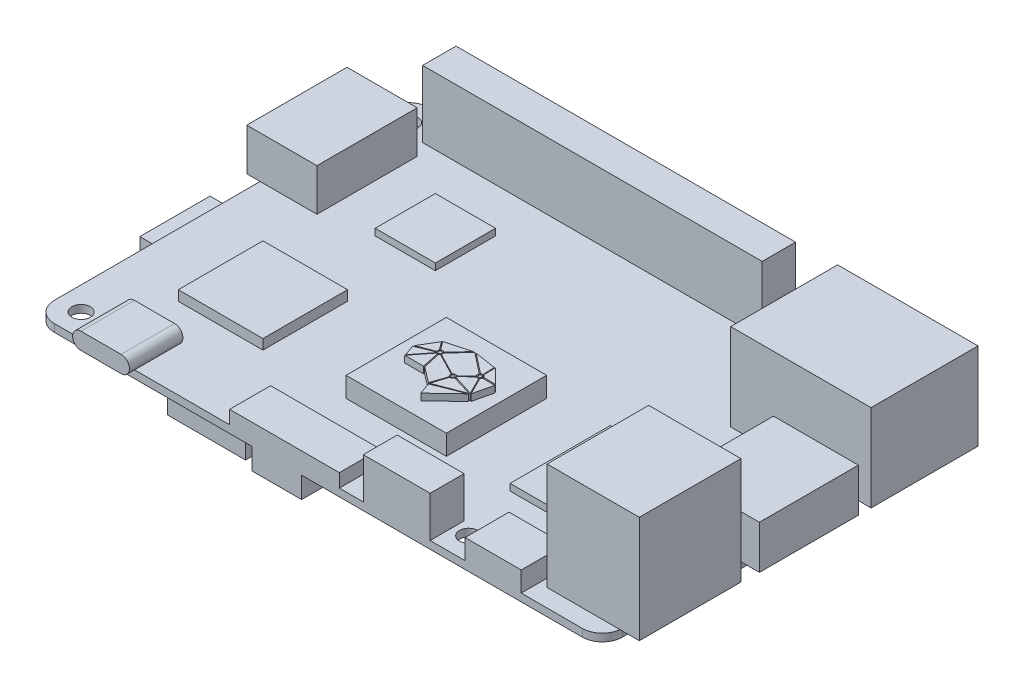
from build123d import *

# Parameters (mm, degrees)
SKETCH_1_W          = 85
SKETCH_1_H          = 56
EXTRUDE_1_DEPTH     = 1.14
FILLET_1_R          = 3
SKETCH_2_W          = 13.8
SKETCH_2_H          = 15.2
EXTRUDE_2_DEPTH     = 16
SKETCH_3_W          = 12.695877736
SKETCH_3_H          = 14.8
EXTRUDE_3_DEPTH     = 6.5
SKETCH_5_W          = 21
SKETCH_5_H          = 16
EXTRUDE_4_DEPTH     = 13
SKETCH_6_R          = 1.38
CUT_EXTRUDE_1_DEPTH = 56.769615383
SKETCH_7_W          = 50.8
SKETCH_7_H          = 5
EXTRUDE_5_DEPTH     = 10
SKETCH_8_W          = 10.5
SKETCH_8_H          = 15
EXTRUDE_6_DEPTH     = 6.3
SKETCH_9_W          = 14.5
SKETCH_9_H          = 14.5
EXTRUDE_7_DEPTH     = 2
SKETCH_10_W         = 8.805174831
SKETCH_10_H         = 10.5
EXTRUDE_8_DEPTH     = 2
EXTRUDE_9_DEPTH     = 8
SKETCH_13_W         = 16.41
SKETCH_13_H         = 6.12
EXTRUDE_10_DEPTH    = 2
SKETCH_14_W         = 10
SKETCH_14_H         = 5.08
EXTRUDE_11_DEPTH    = 6.12
SKETCH_15_W         = 11.7
SKETCH_15_H         = 5
EXTRUDE_12_DEPTH    = 2.81
SKETCH_16_W         = 7.42
SKETCH_16_H         = 5.15
EXTRUDE_13_DEPTH    = 3.18
SKETCH_17_W         = 8.4
SKETCH_17_H         = 6.58
EXTRUDE_14_DEPTH    = 3
SKETCH_19_W         = 12.66
SKETCH_19_H         = 12.66
EXTRUDE_15_DEPTH    = 1.5
SKETCH_20_W         = 15
SKETCH_20_H         = 15
EXTRUDE_16_DEPTH    = 3
SKETCH_22_W         = 10
SKETCH_22_H         = 15
EXTRUDE_17_DEPTH    = 1
SKETCH_23_W         = 9
SKETCH_23_H         = 9
EXTRUDE_18_DEPTH    = 1
SKETCH_27_R         = 0.223898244
SKETCH_27_R_2       = 0.241378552
EXTRUDE_19_DEPTH    = 1


with BuildPart() as part:
    # Sketch 1 → Extrude 1 (new body)
    with BuildSketch(Plane(origin=(0, 0, 0), x_dir=(1, 0, 0), z_dir=(0, 1, 0))):
        Rectangle(SKETCH_1_W, SKETCH_1_H)
    extrude(amount=EXTRUDE_1_DEPTH)

    # Fillet 1
    fillet_1_edges = [part.edges().sort_by_distance(p)[0] for p in [
        (42.5, 0.57, 28),
        (-42.5, 0.57, 28),
        (-42.5, 0.57, -28),
        (42.5, 0.57, -28),
    ]]
    fillet(fillet_1_edges, radius=FILLET_1_R)

    # Sketch 2 → Extrude 2 (add)
    with BuildSketch(Plane(origin=(0, 1.14, 0), x_dir=(1, 0, 0), z_dir=(0, 1, 0))):
        with Locations((38.47, -17.74)):
            Rectangle(SKETCH_2_W, SKETCH_2_H)
    extrude(amount=EXTRUDE_2_DEPTH)

    # Sketch 3 → Extrude 3 (add)
    with BuildSketch(Plane(origin=(0, 1.14, 0), x_dir=(1, 0, 0), z_dir=(0, 1, 0))):
        with Locations((39.152061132, -0.1)):
            Rectangle(SKETCH_3_W, SKETCH_3_H)
    extrude(amount=EXTRUDE_3_DEPTH)

    # Sketch 5 → Extrude 4 (add)
    with BuildSketch(Plane(origin=(0, 1.14, 0), x_dir=(1, 0, 0), z_dir=(0, 1, 0))):
        with Locations((35, 17.2)):
            Rectangle(SKETCH_5_W, SKETCH_5_H)
    extrude(amount=EXTRUDE_4_DEPTH)

    # Sketch 6 → Cut-Extrude 1 (cut, through all)
    with BuildSketch(Plane(origin=(0, 1.14, 0), x_dir=(1, 0, 0), z_dir=(0, 1, 0))):
        with Locations(Location((-39, 24.5, 0), (0, 0, 270))):
            Circle(SKETCH_6_R)
        with Locations(Location((19, 24.5, 0), (0, 0, 270))):
            Circle(SKETCH_6_R)
        with Locations(Location((-38.987121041, -24.499998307, 0), (0, 0, 270))):
            Circle(SKETCH_6_R)
        with Locations(Location((19, -24.5, 0), (0, 0, 270))):
            Circle(SKETCH_6_R)
    extrude(amount=-CUT_EXTRUDE_1_DEPTH, mode=Mode.SUBTRACT)

    # Sketch 7 → Extrude 5 (add)
    with BuildSketch(Plane(origin=(0, 1.14, 0), x_dir=(1, 0, 0), z_dir=(0, 1, 0))):
        with Locations((-9.99, 25.5)):
            Rectangle(SKETCH_7_W, SKETCH_7_H)
    extrude(amount=EXTRUDE_5_DEPTH)

    # Sketch 8 → Extrude 6 (add)
    with BuildSketch(Plane(origin=(0, 1.14, 0), x_dir=(1, 0, 0), z_dir=(0, 1, 0))):
        with Locations((-39.25, 13.3)):
            Rectangle(SKETCH_8_W, SKETCH_8_H)
    extrude(amount=EXTRUDE_6_DEPTH)

    # Sketch 9 → Extrude 7 (add)
    with BuildSketch(Plane.XZ):
        with Locations((-35.25, 2.95)):
            Rectangle(SKETCH_9_W, SKETCH_9_H)
    extrude(amount=EXTRUDE_7_DEPTH)

    # Sketch 10 → Extrude 8 (add)
    with BuildSketch(Plane.XZ.offset(2)):
        with Locations((-41.097412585, 3.95)):
            Rectangle(SKETCH_10_W, SKETCH_10_H)
    extrude(amount=-EXTRUDE_8_DEPTH)

    # Sketch 12 → Extrude 9 (add)
    with BuildSketch(Plane.XY.offset(29.5)):
        with BuildLine():
            Line((-34, 3.64), (-28, 3.64))
            ThreePointArc((-28, 3.64), (-26.75, 2.39), (-28, 1.14))
            Line((-28, 1.14), (-34, 1.14))
            ThreePointArc((-34, 1.14), (-35.25, 2.39), (-34, 3.64))
        make_face()
    extrude(amount=-EXTRUDE_9_DEPTH)

    # Sketch 13 → Extrude 10 (add)
    with BuildSketch(Plane(origin=(0, 1.14, 0), x_dir=(1, 0, 0), z_dir=(0, 1, 0))):
        with Locations((-5.055, -24.94)):
            Rectangle(SKETCH_13_W, SKETCH_13_H)
    extrude(amount=EXTRUDE_10_DEPTH)

    # Sketch 14 → Extrude 11 (add)
    with BuildSketch(Plane(origin=(0, 1.14, 0), x_dir=(1, 0, 0), z_dir=(0, 1, 0))):
        with Locations((11.73, -25.46)):
            Rectangle(SKETCH_14_W, SKETCH_14_H)
    extrude(amount=EXTRUDE_11_DEPTH)

    # Sketch 15 → Extrude 12 (add)
    with BuildSketch(Plane.XZ):
        with Locations((-17.3, 24.93)):
            Rectangle(SKETCH_15_W, SKETCH_15_H)
    extrude(amount=EXTRUDE_12_DEPTH)

    # Sketch 16 → Extrude 13 (add)
    with BuildSketch(Plane.XZ):
        with Locations((-6.21, 25.425)):
            Rectangle(SKETCH_16_W, SKETCH_16_H)
    extrude(amount=EXTRUDE_13_DEPTH)

    # Sketch 17 → Extrude 14 (add)
    with BuildSketch(Plane(origin=(0, 1.14, 0), x_dir=(1, 0, 0), z_dir=(0, 1, 0))):
        with Locations((26.16, -24.71)):
            Rectangle(SKETCH_17_W, SKETCH_17_H)
    extrude(amount=EXTRUDE_14_DEPTH)

    # Sketch 19 → Extrude 15 (add)
    with BuildSketch(Plane(origin=(0, 1.14, 0), x_dir=(1, 0, 0), z_dir=(0, 1, 0))):
        with Locations((-26.77, -9.51)):
            Rectangle(SKETCH_19_W, SKETCH_19_H)
    extrude(amount=EXTRUDE_15_DEPTH)

    # Sketch 20 → Extrude 16 (add)
    with BuildSketch(Plane(origin=(0, 1.14, 0), x_dir=(1, 0, 0), z_dir=(0, 1, 0))):
        with Locations((-0.46, -8.38)):
            Rectangle(SKETCH_20_W, SKETCH_20_H)
    extrude(amount=EXTRUDE_16_DEPTH)

    # Sketch 22 → Extrude 17 (add)
    with BuildSketch(Plane(origin=(0, 1.14, 0), x_dir=(1, 0, 0), z_dir=(0, 1, 0))):
        with Locations((21.31, -8.11)):
            Rectangle(SKETCH_22_W, SKETCH_22_H)
    extrude(amount=EXTRUDE_17_DEPTH)

    # Sketch 23 → Extrude 18 (add)
    with BuildSketch(Plane(origin=(0, 1.14, 0), x_dir=(1, 0, 0), z_dir=(0, 1, 0))):
        with Locations((-22.33, 11.85)):
            Rectangle(SKETCH_23_W, SKETCH_23_H)
    extrude(amount=EXTRUDE_18_DEPTH)

    # Sketch 27 → Extrude 19 (add)
    with BuildSketch(Plane(origin=(0, 4.14, 0), x_dir=(1, 0, 0), z_dir=(0, 1, 0))):
        with BuildLine():
            ThreePointArc((-2.901062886, -7.290073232), (-2.992481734, -7.279969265), (-3.079487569, -7.250145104))
            Line((-3.079487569, -7.250145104), (-5.163914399, -9.899238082))
            Line((-5.163914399, -9.899238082), (-2.346963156, -9.899238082))
            Line((-2.346963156, -9.899238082), (-2.901062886, -7.290073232))
        make_face()
        with BuildLine():
            ThreePointArc((-3.159477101, -7.200793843), (-3.206691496, -7.15752055), (-3.246752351, -7.107551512))
            Line((-3.246752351, -7.107551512), (-5.759446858, -8.122602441))
            Line((-5.759446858, -8.122602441), (-5.171092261, -9.764551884))
            Line((-5.171092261, -9.764551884), (-3.159477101, -7.200793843))
        make_face()
        with BuildLine():
            ThreePointArc((-3.293436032, -7.017355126), (-3.316593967, -6.82066998), (-3.246752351, -6.635350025))
            Line((-3.246752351, -6.635350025), (-4.185212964, -5.374349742))
            Line((-4.185212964, -5.374349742), (-5.669294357, -7.900820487))
            Line((-5.669294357, -7.900820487), (-3.293436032, -7.017355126))
        make_face()
        with BuildLine():
            Line((-0.285994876, -4.287414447), (-2.529479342, -6.678654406))
            ThreePointArc((-2.529479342, -6.678654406), (-2.494370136, -6.772224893), (-2.482440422, -6.871450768))
            ThreePointArc((-2.482440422, -6.871450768), (-2.493288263, -6.966132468), (-2.525269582, -7.055907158))
            Line((-2.525269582, -7.055907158), (0.805689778, -8.774352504))
            ThreePointArc((0.805689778, -8.774352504), (1.063865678, -8.599945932), (1.368305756, -8.666193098))
            Line((1.368305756, -8.666193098), (2.884421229, -7.261576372))
            ThreePointArc((2.884421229, -7.261576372), (2.764376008, -7.009753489), (2.826088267, -6.737692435))
            Line((2.826088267, -6.737692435), (-0.285994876, -4.287414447))
        make_face()
        with BuildLine():
            Line((0.762609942, -8.864423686), (-2.57886817, -7.138724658))
            ThreePointArc((-2.57886817, -7.138724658), (-2.656228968, -7.211010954), (-2.749251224, -7.261576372))
            Line((-2.749251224, -7.261576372), (-2.174800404, -9.899238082))
            Line((-2.174800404, -9.899238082), (0.160506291, -11.666977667))
            Line((0.160506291, -11.666977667), (0.945361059, -9.334697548))
            ThreePointArc((0.945361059, -9.334697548), (0.769429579, -9.132419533), (0.762609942, -8.864423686))
        make_face()
        with BuildLine():
            ThreePointArc((1.517848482, -9.103458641), (1.338525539, -9.330929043), (1.052326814, -9.375536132))
            Line((1.052326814, -9.375536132), (0.318880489, -11.666977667))
            Line((0.318880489, -11.666977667), (4.595981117, -10.033058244))
            Line((4.595981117, -10.033058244), (1.517848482, -9.103458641))
        make_face()
        with BuildLine():
            ThreePointArc((3.376531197, -7.343834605), (3.18731618, -7.388214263), (2.998101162, -7.343834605))
            Line((2.998101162, -7.343834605), (1.471604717, -8.774352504))
            ThreePointArc((1.471604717, -8.774352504), (1.508385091, -8.846805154), (1.529608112, -8.925238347))
            Line((1.529608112, -8.925238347), (4.645034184, -9.899238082))
            Line((4.645034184, -9.899238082), (3.376531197, -7.343834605))
        make_face()
        with BuildLine():
            ThreePointArc((3.602528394, -7.055907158), (3.550246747, -7.184870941), (3.459156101, -7.290073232))
            Line((3.459156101, -7.290073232), (4.78138121, -9.899238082))
            Line((4.78138121, -9.899238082), (5.466577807, -7.055907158))
            Line((5.466577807, -7.055907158), (3.602528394, -7.055907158))
        make_face()
        with Locations(Location((3.18731618, -6.962660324, 0), (0, 0, 270))):
            Circle(SKETCH_27_R)
        with BuildLine():
            Line((-0.100298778, -4.287414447), (2.915352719, -6.635350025))
            ThreePointArc((2.915352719, -6.635350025), (3.042734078, -6.562420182), (3.18731618, -6.537106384))
            Line((3.18731618, -6.537106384), (3.12040525, -4.780670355))
            Line((3.12040525, -4.780670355), (-0.100298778, -4.287414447))
        make_face()
        with BuildLine():
            Line((3.261380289, -4.780670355), (3.261380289, -6.543601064))
            ThreePointArc((3.261380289, -6.543601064), (3.481231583, -6.654910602), (3.602528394, -6.869413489))
            Line((3.602528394, -6.869413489), (5.350123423, -6.869413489))
            Line((5.350123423, -6.869413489), (3.261380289, -4.780670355))
        make_face()
        with BuildLine():
            Line((-4.103362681, -5.278649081), (-3.153268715, -6.537329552))
            ThreePointArc((-3.153268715, -6.537329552), (-2.895940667, -6.452859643), (-2.640756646, -6.543601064))
            Line((-2.640756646, -6.543601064), (-0.502430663, -4.287414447))
            Line((-0.502430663, -4.287414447), (-4.103362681, -5.278649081))
        make_face()
        Polygon((0.318880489, -11.842824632), (0.945361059, -13.593721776), (4.595981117, -10.126165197), align=None)
        with Locations(Location((-2.901062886, -6.871450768, 0), (0, 0, 270))):
            Circle(SKETCH_27_R_2)
        with Locations(Location((1.138647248, -8.988939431, 0), (0, 0, 270))):
            Circle(SKETCH_27_R)
    extrude(amount=EXTRUDE_19_DEPTH)


solid = part.part
